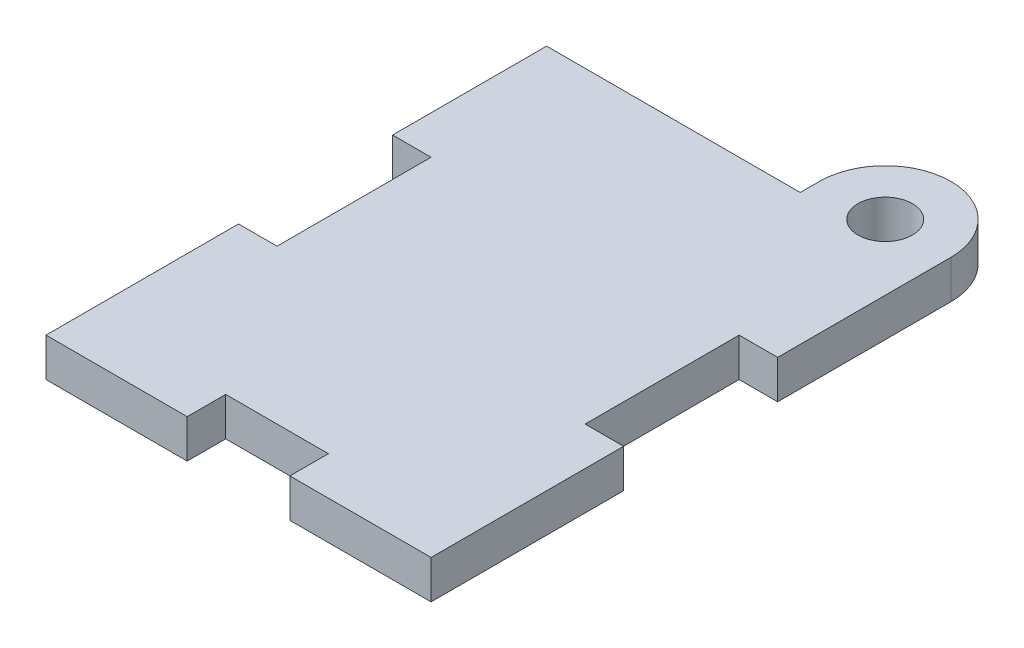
ISO-10303-21;
HEADER;
FILE_DESCRIPTION(('STEP AP214'),'2;1');
FILE_NAME('part.step','',(''),(''),'','','');
FILE_SCHEMA(('AUTOMOTIVE_DESIGN { 1 0 10303 214 1 1 1 1 }'));
ENDSEC;
DATA;
#1=APPLICATION_CONTEXT('core data for automotive mechanical design processes');
#2=APPLICATION_PROTOCOL_DEFINITION('international standard','automotive_design',2000,#1);
#3=PRODUCT_CONTEXT('',#1,'mechanical');
#4=PRODUCT('Part','Part','',(#3));
#5=PRODUCT_RELATED_PRODUCT_CATEGORY('part','',(#4));
#6=PRODUCT_DEFINITION_FORMATION('','',#4);
#7=PRODUCT_DEFINITION_CONTEXT('part definition',#1,'design');
#8=PRODUCT_DEFINITION('design','',#6,#7);
#9=PRODUCT_DEFINITION_SHAPE('','',#8);
#10=(LENGTH_UNIT() NAMED_UNIT(*) SI_UNIT(.MILLI.,.METRE.));
#11=(NAMED_UNIT(*) PLANE_ANGLE_UNIT() SI_UNIT($,.RADIAN.));
#12=(NAMED_UNIT(*) SI_UNIT($,.STERADIAN.) SOLID_ANGLE_UNIT());
#13=UNCERTAINTY_MEASURE_WITH_UNIT(LENGTH_MEASURE(1.E-05),#10,'distance_accuracy_value','');
#14=(GEOMETRIC_REPRESENTATION_CONTEXT(3) GLOBAL_UNCERTAINTY_ASSIGNED_CONTEXT((#13)) GLOBAL_UNIT_ASSIGNED_CONTEXT((#10,
#11,#12)) REPRESENTATION_CONTEXT('',''));
#15=CARTESIAN_POINT('',(0.,0.,0.));
#16=DIRECTION('',(0.,0.,1.));
#17=DIRECTION('',(1.,0.,0.));
#18=AXIS2_PLACEMENT_3D('',#15,#16,#17);
#19=CARTESIAN_POINT('',(10.4549359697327,3.175,-39.6875));
#20=DIRECTION('',(0.,-1.,0.));
#21=DIRECTION('',(0.,0.,-1.));
#22=AXIS2_PLACEMENT_3D('',#19,#20,#21);
#23=PLANE('',#22);
#24=DIRECTION('',(0.,0.,1.));
#25=VECTOR('',#24,1.);
#26=CARTESIAN_POINT('',(-15.875,3.175,-25.4));
#27=LINE('',#26,#25);
#28=CARTESIAN_POINT('',(-15.875,3.175,-38.1));
#29=VERTEX_POINT('',#28);
#30=CARTESIAN_POINT('',(-15.875,3.175,-25.4));
#31=VERTEX_POINT('',#30);
#32=EDGE_CURVE('E267',#29,#31,#27,.T.);
#33=ORIENTED_EDGE('',*,*,#32,.T.);
#34=DIRECTION('',(1.,0.,0.));
#35=VECTOR('',#34,1.);
#36=CARTESIAN_POINT('',(-12.7,3.175,-25.4));
#37=LINE('',#36,#35);
#38=CARTESIAN_POINT('',(-12.7,3.175,-25.4));
#39=VERTEX_POINT('',#38);
#40=EDGE_CURVE('E126',#31,#39,#37,.T.);
#41=ORIENTED_EDGE('',*,*,#40,.T.);
#42=DIRECTION('',(0.,0.,1.));
#43=VECTOR('',#42,1.);
#44=CARTESIAN_POINT('',(-12.7,3.175,-12.7));
#45=LINE('',#44,#43);
#46=CARTESIAN_POINT('',(-12.7,3.175,-12.7));
#47=VERTEX_POINT('',#46);
#48=EDGE_CURVE('E261',#39,#47,#45,.T.);
#49=ORIENTED_EDGE('',*,*,#48,.T.);
#50=DIRECTION('',(-1.,0.,0.));
#51=VECTOR('',#50,1.);
#52=CARTESIAN_POINT('',(-15.875,3.175,-12.7));
#53=LINE('',#52,#51);
#54=CARTESIAN_POINT('',(-15.875,3.175,-12.7));
#55=VERTEX_POINT('',#54);
#56=EDGE_CURVE('E253',#47,#55,#53,.T.);
#57=ORIENTED_EDGE('',*,*,#56,.T.);
#58=DIRECTION('',(0.,0.,1.));
#59=VECTOR('',#58,1.);
#60=CARTESIAN_POINT('',(-15.875,3.175,3.175));
#61=LINE('',#60,#59);
#62=CARTESIAN_POINT('',(-15.875,3.175,3.175));
#63=VERTEX_POINT('',#62);
#64=EDGE_CURVE('E249',#55,#63,#61,.T.);
#65=ORIENTED_EDGE('',*,*,#64,.T.);
#66=DIRECTION('',(1.,0.,0.));
#67=VECTOR('',#66,1.);
#68=CARTESIAN_POINT('',(-4.23333333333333,3.175,3.175));
#69=LINE('',#68,#67);
#70=CARTESIAN_POINT('',(-4.23333333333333,3.175,3.175));
#71=VERTEX_POINT('',#70);
#72=EDGE_CURVE('E245',#63,#71,#69,.T.);
#73=ORIENTED_EDGE('',*,*,#72,.T.);
#74=DIRECTION('',(0.,0.,-1.));
#75=VECTOR('',#74,1.);
#76=CARTESIAN_POINT('',(-4.23333333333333,3.175,0.));
#77=LINE('',#76,#75);
#78=CARTESIAN_POINT('',(-4.23333333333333,3.175,0.));
#79=VERTEX_POINT('',#78);
#80=EDGE_CURVE('E242',#71,#79,#77,.T.);
#81=ORIENTED_EDGE('',*,*,#80,.T.);
#82=DIRECTION('',(1.,0.,0.));
#83=VECTOR('',#82,1.);
#84=CARTESIAN_POINT('',(4.23333333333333,3.175,0.));
#85=LINE('',#84,#83);
#86=CARTESIAN_POINT('',(4.23333333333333,3.175,0.));
#87=VERTEX_POINT('',#86);
#88=EDGE_CURVE('E234',#79,#87,#85,.T.);
#89=ORIENTED_EDGE('',*,*,#88,.T.);
#90=DIRECTION('',(0.,0.,1.));
#91=VECTOR('',#90,1.);
#92=CARTESIAN_POINT('',(4.23333333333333,3.175,3.175));
#93=LINE('',#92,#91);
#94=CARTESIAN_POINT('',(4.23333333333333,3.175,3.175));
#95=VERTEX_POINT('',#94);
#96=EDGE_CURVE('E230',#87,#95,#93,.T.);
#97=ORIENTED_EDGE('',*,*,#96,.T.);
#98=DIRECTION('',(1.,0.,0.));
#99=VECTOR('',#98,1.);
#100=CARTESIAN_POINT('',(15.875,3.175,3.175));
#101=LINE('',#100,#99);
#102=CARTESIAN_POINT('',(15.875,3.175,3.175));
#103=VERTEX_POINT('',#102);
#104=EDGE_CURVE('E226',#95,#103,#101,.T.);
#105=ORIENTED_EDGE('',*,*,#104,.T.);
#106=DIRECTION('',(0.,0.,-1.));
#107=VECTOR('',#106,1.);
#108=CARTESIAN_POINT('',(15.875,3.175,-12.7));
#109=LINE('',#108,#107);
#110=CARTESIAN_POINT('',(15.875,3.175,-12.7));
#111=VERTEX_POINT('',#110);
#112=EDGE_CURVE('E223',#103,#111,#109,.T.);
#113=ORIENTED_EDGE('',*,*,#112,.T.);
#114=DIRECTION('',(-1.,0.,0.));
#115=VECTOR('',#114,1.);
#116=CARTESIAN_POINT('',(12.7,3.175,-12.7));
#117=LINE('',#116,#115);
#118=CARTESIAN_POINT('',(12.7,3.175,-12.7));
#119=VERTEX_POINT('',#118);
#120=EDGE_CURVE('E215',#111,#119,#117,.T.);
#121=ORIENTED_EDGE('',*,*,#120,.T.);
#122=DIRECTION('',(0.,0.,-1.));
#123=VECTOR('',#122,1.);
#124=CARTESIAN_POINT('',(12.7,3.175,-25.4));
#125=LINE('',#124,#123);
#126=CARTESIAN_POINT('',(12.7,3.175,-25.4));
#127=VERTEX_POINT('',#126);
#128=EDGE_CURVE('E211',#119,#127,#125,.T.);
#129=ORIENTED_EDGE('',*,*,#128,.T.);
#130=DIRECTION('',(1.,0.,0.));
#131=VECTOR('',#130,1.);
#132=CARTESIAN_POINT('',(15.875,3.175,-25.4));
#133=LINE('',#132,#131);
#134=CARTESIAN_POINT('',(15.875,3.175,-25.4));
#135=VERTEX_POINT('',#134);
#136=EDGE_CURVE('E207',#127,#135,#133,.T.);
#137=ORIENTED_EDGE('',*,*,#136,.T.);
#138=DIRECTION('',(0.,0.,-1.));
#139=VECTOR('',#138,1.);
#140=CARTESIAN_POINT('',(15.875,3.175,-39.6875));
#141=LINE('',#140,#139);
#142=CARTESIAN_POINT('',(15.875,3.175,-39.6875));
#143=VERTEX_POINT('',#142);
#144=EDGE_CURVE('E175',#135,#143,#141,.T.);
#145=ORIENTED_EDGE('',*,*,#144,.T.);
#146=CARTESIAN_POINT('',(10.4549359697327,3.175,-39.6875));
#147=DIRECTION('',(0.,1.,0.));
#148=DIRECTION('',(0.,0.,-1.));
#149=AXIS2_PLACEMENT_3D('',#146,#147,#148);
#150=CIRCLE('',#149,5.42006403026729);
#151=CARTESIAN_POINT('',(5.03487193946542,3.175,-39.6875));
#152=VERTEX_POINT('',#151);
#153=EDGE_CURVE('E169',#143,#152,#150,.T.);
#154=ORIENTED_EDGE('',*,*,#153,.T.);
#155=DIRECTION('',(0.,0.,1.));
#156=VECTOR('',#155,1.);
#157=CARTESIAN_POINT('',(5.03487193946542,3.175,-38.1));
#158=LINE('',#157,#156);
#159=CARTESIAN_POINT('',(5.03487193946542,3.175,-38.1));
#160=VERTEX_POINT('',#159);
#161=EDGE_CURVE('E173',#152,#160,#158,.T.);
#162=ORIENTED_EDGE('',*,*,#161,.T.);
#163=DIRECTION('',(-1.,0.,0.));
#164=VECTOR('',#163,1.);
#165=CARTESIAN_POINT('',(-15.875,3.175,-38.1));
#166=LINE('',#165,#164);
#167=EDGE_CURVE('E53',#160,#29,#166,.T.);
#168=ORIENTED_EDGE('',*,*,#167,.T.);
#169=EDGE_LOOP('',(#33,#41,#49,#57,#65,#73,#81,#89,#97,#105,#113,#121,#129,#137,#145,#154,#162,#168));
#170=FACE_BOUND('',#169,.T.);
#171=CARTESIAN_POINT('',(10.4549359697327,3.175,-39.6875));
#172=DIRECTION('',(0.,1.,0.));
#173=DIRECTION('',(0.,0.,1.));
#174=AXIS2_PLACEMENT_3D('',#171,#172,#173);
#175=CIRCLE('',#174,2.24506403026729);
#176=CARTESIAN_POINT('',(10.4549359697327,3.175,-37.4424359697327));
#177=VERTEX_POINT('',#176);
#178=EDGE_CURVE('E273',#177,#177,#175,.T.);
#179=ORIENTED_EDGE('',*,*,#178,.F.);
#180=EDGE_LOOP('',(#179));
#181=FACE_BOUND('',#180,.T.);
#182=ADVANCED_FACE('F36',(#170,#181),#23,.F.);
#183=CARTESIAN_POINT('',(10.4549359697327,0.,-39.6875));
#184=DIRECTION('',(0.,-1.,0.));
#185=DIRECTION('',(0.,0.,-1.));
#186=AXIS2_PLACEMENT_3D('',#183,#184,#185);
#187=PLANE('',#186);
#188=DIRECTION('',(0.,0.,1.));
#189=VECTOR('',#188,1.);
#190=CARTESIAN_POINT('',(-15.875,0.,-25.4));
#191=LINE('',#190,#189);
#192=CARTESIAN_POINT('',(-15.875,0.,-38.1));
#193=VERTEX_POINT('',#192);
#194=CARTESIAN_POINT('',(-15.875,0.,-25.4));
#195=VERTEX_POINT('',#194);
#196=EDGE_CURVE('E277',#193,#195,#191,.T.);
#197=ORIENTED_EDGE('',*,*,#196,.F.);
#198=DIRECTION('',(-1.,0.,0.));
#199=VECTOR('',#198,1.);
#200=CARTESIAN_POINT('',(-15.875,0.,-38.1));
#201=LINE('',#200,#199);
#202=CARTESIAN_POINT('',(5.03487193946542,0.,-38.1));
#203=VERTEX_POINT('',#202);
#204=EDGE_CURVE('E118',#203,#193,#201,.T.);
#205=ORIENTED_EDGE('',*,*,#204,.F.);
#206=DIRECTION('',(0.,0.,1.));
#207=VECTOR('',#206,1.);
#208=CARTESIAN_POINT('',(5.03487193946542,0.,-38.1));
#209=LINE('',#208,#207);
#210=CARTESIAN_POINT('',(5.03487193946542,0.,-39.6875));
#211=VERTEX_POINT('',#210);
#212=EDGE_CURVE('E112',#211,#203,#209,.T.);
#213=ORIENTED_EDGE('',*,*,#212,.F.);
#214=CARTESIAN_POINT('',(10.4549359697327,0.,-39.6875));
#215=DIRECTION('',(0.,1.,0.));
#216=DIRECTION('',(0.,0.,-1.));
#217=AXIS2_PLACEMENT_3D('',#214,#215,#216);
#218=CIRCLE('',#217,5.42006403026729);
#219=CARTESIAN_POINT('',(15.875,0.,-39.6875));
#220=VERTEX_POINT('',#219);
#221=EDGE_CURVE('E184',#220,#211,#218,.T.);
#222=ORIENTED_EDGE('',*,*,#221,.F.);
#223=DIRECTION('',(0.,0.,-1.));
#224=VECTOR('',#223,1.);
#225=CARTESIAN_POINT('',(15.875,0.,-39.6875));
#226=LINE('',#225,#224);
#227=CARTESIAN_POINT('',(15.875,0.,-25.4));
#228=VERTEX_POINT('',#227);
#229=EDGE_CURVE('E311',#228,#220,#226,.T.);
#230=ORIENTED_EDGE('',*,*,#229,.F.);
#231=DIRECTION('',(1.,0.,0.));
#232=VECTOR('',#231,1.);
#233=CARTESIAN_POINT('',(15.875,0.,-25.4));
#234=LINE('',#233,#232);
#235=CARTESIAN_POINT('',(12.7,0.,-25.4));
#236=VERTEX_POINT('',#235);
#237=EDGE_CURVE('E309',#236,#228,#234,.T.);
#238=ORIENTED_EDGE('',*,*,#237,.F.);
#239=DIRECTION('',(0.,0.,-1.));
#240=VECTOR('',#239,1.);
#241=CARTESIAN_POINT('',(12.7,0.,-25.4));
#242=LINE('',#241,#240);
#243=CARTESIAN_POINT('',(12.7,0.,-12.7));
#244=VERTEX_POINT('',#243);
#245=EDGE_CURVE('E307',#244,#236,#242,.T.);
#246=ORIENTED_EDGE('',*,*,#245,.F.);
#247=DIRECTION('',(-1.,0.,0.));
#248=VECTOR('',#247,1.);
#249=CARTESIAN_POINT('',(12.7,0.,-12.7));
#250=LINE('',#249,#248);
#251=CARTESIAN_POINT('',(15.875,0.,-12.7));
#252=VERTEX_POINT('',#251);
#253=EDGE_CURVE('E305',#252,#244,#250,.T.);
#254=ORIENTED_EDGE('',*,*,#253,.F.);
#255=DIRECTION('',(0.,0.,-1.));
#256=VECTOR('',#255,1.);
#257=CARTESIAN_POINT('',(15.875,0.,-12.7));
#258=LINE('',#257,#256);
#259=CARTESIAN_POINT('',(15.875,0.,3.175));
#260=VERTEX_POINT('',#259);
#261=EDGE_CURVE('E303',#260,#252,#258,.T.);
#262=ORIENTED_EDGE('',*,*,#261,.F.);
#263=DIRECTION('',(1.,0.,0.));
#264=VECTOR('',#263,1.);
#265=CARTESIAN_POINT('',(15.875,0.,3.175));
#266=LINE('',#265,#264);
#267=CARTESIAN_POINT('',(4.23333333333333,0.,3.175));
#268=VERTEX_POINT('',#267);
#269=EDGE_CURVE('E301',#268,#260,#266,.T.);
#270=ORIENTED_EDGE('',*,*,#269,.F.);
#271=DIRECTION('',(0.,0.,1.));
#272=VECTOR('',#271,1.);
#273=CARTESIAN_POINT('',(4.23333333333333,0.,3.175));
#274=LINE('',#273,#272);
#275=CARTESIAN_POINT('',(4.23333333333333,0.,0.));
#276=VERTEX_POINT('',#275);
#277=EDGE_CURVE('E299',#276,#268,#274,.T.);
#278=ORIENTED_EDGE('',*,*,#277,.F.);
#279=DIRECTION('',(1.,0.,0.));
#280=VECTOR('',#279,1.);
#281=CARTESIAN_POINT('',(4.23333333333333,0.,0.));
#282=LINE('',#281,#280);
#283=CARTESIAN_POINT('',(-4.23333333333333,0.,0.));
#284=VERTEX_POINT('',#283);
#285=EDGE_CURVE('E297',#284,#276,#282,.T.);
#286=ORIENTED_EDGE('',*,*,#285,.F.);
#287=DIRECTION('',(0.,0.,-1.));
#288=VECTOR('',#287,1.);
#289=CARTESIAN_POINT('',(-4.23333333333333,0.,0.));
#290=LINE('',#289,#288);
#291=CARTESIAN_POINT('',(-4.23333333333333,0.,3.175));
#292=VERTEX_POINT('',#291);
#293=EDGE_CURVE('E295',#292,#284,#290,.T.);
#294=ORIENTED_EDGE('',*,*,#293,.F.);
#295=DIRECTION('',(1.,0.,0.));
#296=VECTOR('',#295,1.);
#297=CARTESIAN_POINT('',(-4.23333333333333,0.,3.175));
#298=LINE('',#297,#296);
#299=CARTESIAN_POINT('',(-15.875,0.,3.175));
#300=VERTEX_POINT('',#299);
#301=EDGE_CURVE('E293',#300,#292,#298,.T.);
#302=ORIENTED_EDGE('',*,*,#301,.F.);
#303=DIRECTION('',(0.,0.,1.));
#304=VECTOR('',#303,1.);
#305=CARTESIAN_POINT('',(-15.875,0.,3.175));
#306=LINE('',#305,#304);
#307=CARTESIAN_POINT('',(-15.875,0.,-12.7));
#308=VERTEX_POINT('',#307);
#309=EDGE_CURVE('E291',#308,#300,#306,.T.);
#310=ORIENTED_EDGE('',*,*,#309,.F.);
#311=DIRECTION('',(-1.,0.,0.));
#312=VECTOR('',#311,1.);
#313=CARTESIAN_POINT('',(-15.875,0.,-12.7));
#314=LINE('',#313,#312);
#315=CARTESIAN_POINT('',(-12.7,0.,-12.7));
#316=VERTEX_POINT('',#315);
#317=EDGE_CURVE('E289',#316,#308,#314,.T.);
#318=ORIENTED_EDGE('',*,*,#317,.F.);
#319=DIRECTION('',(0.,0.,1.));
#320=VECTOR('',#319,1.);
#321=CARTESIAN_POINT('',(-12.7,0.,-12.7));
#322=LINE('',#321,#320);
#323=CARTESIAN_POINT('',(-12.7,0.,-25.4));
#324=VERTEX_POINT('',#323);
#325=EDGE_CURVE('E285',#324,#316,#322,.T.);
#326=ORIENTED_EDGE('',*,*,#325,.F.);
#327=DIRECTION('',(1.,0.,0.));
#328=VECTOR('',#327,1.);
#329=CARTESIAN_POINT('',(-12.7,0.,-25.4));
#330=LINE('',#329,#328);
#331=EDGE_CURVE('E281',#195,#324,#330,.T.);
#332=ORIENTED_EDGE('',*,*,#331,.F.);
#333=EDGE_LOOP('',(#197,#205,#213,#222,#230,#238,#246,#254,#262,#270,#278,#286,#294,#302,#310,
#318,#326,#332));
#334=FACE_BOUND('',#333,.T.);
#335=CARTESIAN_POINT('',(10.4549359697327,0.,-39.6875));
#336=DIRECTION('',(0.,1.,0.));
#337=DIRECTION('',(0.,0.,1.));
#338=AXIS2_PLACEMENT_3D('',#335,#336,#337);
#339=CIRCLE('',#338,2.24506403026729);
#340=CARTESIAN_POINT('',(10.4549359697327,0.,-37.4424359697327));
#341=VERTEX_POINT('',#340);
#342=EDGE_CURVE('E271',#341,#341,#339,.T.);
#343=ORIENTED_EDGE('',*,*,#342,.T.);
#344=EDGE_LOOP('',(#343));
#345=FACE_BOUND('',#344,.T.);
#346=ADVANCED_FACE('F362',(#334,#345),#187,.T.);
#347=CARTESIAN_POINT('',(-15.875,3.175,-25.4));
#348=DIRECTION('',(1.,0.,0.));
#349=DIRECTION('',(0.,0.,-1.));
#350=AXIS2_PLACEMENT_3D('',#347,#348,#349);
#351=PLANE('',#350);
#352=ORIENTED_EDGE('',*,*,#196,.T.);
#353=DIRECTION('',(0.,-1.,0.));
#354=VECTOR('',#353,1.);
#355=CARTESIAN_POINT('',(-15.875,3.175,-25.4));
#356=LINE('',#355,#354);
#357=EDGE_CURVE('E12',#31,#195,#356,.T.);
#358=ORIENTED_EDGE('',*,*,#357,.F.);
#359=ORIENTED_EDGE('',*,*,#32,.F.);
#360=DIRECTION('',(0.,-1.,0.));
#361=VECTOR('',#360,1.);
#362=CARTESIAN_POINT('',(-15.875,3.175,-38.1));
#363=LINE('',#362,#361);
#364=EDGE_CURVE('E192',#29,#193,#363,.T.);
#365=ORIENTED_EDGE('',*,*,#364,.T.);
#366=EDGE_LOOP('',(#352,#358,#359,#365));
#367=FACE_BOUND('',#366,.T.);
#368=ADVANCED_FACE('F38',(#367),#351,.F.);
#369=CARTESIAN_POINT('',(-12.7,3.175,-25.4));
#370=DIRECTION('',(0.,0.,-1.));
#371=DIRECTION('',(-1.,0.,0.));
#372=AXIS2_PLACEMENT_3D('',#369,#370,#371);
#373=PLANE('',#372);
#374=ORIENTED_EDGE('',*,*,#331,.T.);
#375=DIRECTION('',(0.,-1.,0.));
#376=VECTOR('',#375,1.);
#377=CARTESIAN_POINT('',(-12.7,3.175,-25.4));
#378=LINE('',#377,#376);
#379=EDGE_CURVE('E45',#39,#324,#378,.T.);
#380=ORIENTED_EDGE('',*,*,#379,.F.);
#381=ORIENTED_EDGE('',*,*,#40,.F.);
#382=ORIENTED_EDGE('',*,*,#357,.T.);
#383=EDGE_LOOP('',(#374,#380,#381,#382));
#384=FACE_BOUND('',#383,.T.);
#385=ADVANCED_FACE('F564',(#384),#373,.F.);
#386=CARTESIAN_POINT('',(-12.7,3.175,-12.7));
#387=DIRECTION('',(1.,0.,0.));
#388=DIRECTION('',(0.,0.,-1.));
#389=AXIS2_PLACEMENT_3D('',#386,#387,#388);
#390=PLANE('',#389);
#391=ORIENTED_EDGE('',*,*,#325,.T.);
#392=DIRECTION('',(0.,-1.,0.));
#393=VECTOR('',#392,1.);
#394=CARTESIAN_POINT('',(-12.7,3.175,-12.7));
#395=LINE('',#394,#393);
#396=EDGE_CURVE('E352',#47,#316,#395,.T.);
#397=ORIENTED_EDGE('',*,*,#396,.F.);
#398=ORIENTED_EDGE('',*,*,#48,.F.);
#399=ORIENTED_EDGE('',*,*,#379,.T.);
#400=EDGE_LOOP('',(#391,#397,#398,#399));
#401=FACE_BOUND('',#400,.T.);
#402=ADVANCED_FACE('F358',(#401),#390,.F.);
#403=CARTESIAN_POINT('',(-15.875,3.175,-12.7));
#404=DIRECTION('',(0.,0.,1.));
#405=DIRECTION('',(1.,0.,0.));
#406=AXIS2_PLACEMENT_3D('',#403,#404,#405);
#407=PLANE('',#406);
#408=ORIENTED_EDGE('',*,*,#317,.T.);
#409=DIRECTION('',(0.,-1.,0.));
#410=VECTOR('',#409,1.);
#411=CARTESIAN_POINT('',(-15.875,3.175,-12.7));
#412=LINE('',#411,#410);
#413=EDGE_CURVE('E349',#55,#308,#412,.T.);
#414=ORIENTED_EDGE('',*,*,#413,.F.);
#415=ORIENTED_EDGE('',*,*,#56,.F.);
#416=ORIENTED_EDGE('',*,*,#396,.T.);
#417=EDGE_LOOP('',(#408,#414,#415,#416));
#418=FACE_BOUND('',#417,.T.);
#419=ADVANCED_FACE('F368',(#418),#407,.F.);
#420=CARTESIAN_POINT('',(-15.875,3.175,3.175));
#421=DIRECTION('',(1.,0.,0.));
#422=DIRECTION('',(0.,0.,-1.));
#423=AXIS2_PLACEMENT_3D('',#420,#421,#422);
#424=PLANE('',#423);
#425=ORIENTED_EDGE('',*,*,#309,.T.);
#426=DIRECTION('',(0.,-1.,0.));
#427=VECTOR('',#426,1.);
#428=CARTESIAN_POINT('',(-15.875,3.175,3.175));
#429=LINE('',#428,#427);
#430=EDGE_CURVE('E346',#63,#300,#429,.T.);
#431=ORIENTED_EDGE('',*,*,#430,.F.);
#432=ORIENTED_EDGE('',*,*,#64,.F.);
#433=ORIENTED_EDGE('',*,*,#413,.T.);
#434=EDGE_LOOP('',(#425,#431,#432,#433));
#435=FACE_BOUND('',#434,.T.);
#436=ADVANCED_FACE('F372',(#435),#424,.F.);
#437=CARTESIAN_POINT('',(-4.23333333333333,3.175,3.175));
#438=DIRECTION('',(0.,0.,-1.));
#439=DIRECTION('',(-1.,0.,0.));
#440=AXIS2_PLACEMENT_3D('',#437,#438,#439);
#441=PLANE('',#440);
#442=ORIENTED_EDGE('',*,*,#301,.T.);
#443=DIRECTION('',(0.,-1.,0.));
#444=VECTOR('',#443,1.);
#445=CARTESIAN_POINT('',(-4.23333333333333,3.175,3.175));
#446=LINE('',#445,#444);
#447=EDGE_CURVE('E343',#71,#292,#446,.T.);
#448=ORIENTED_EDGE('',*,*,#447,.F.);
#449=ORIENTED_EDGE('',*,*,#72,.F.);
#450=ORIENTED_EDGE('',*,*,#430,.T.);
#451=EDGE_LOOP('',(#442,#448,#449,#450));
#452=FACE_BOUND('',#451,.T.);
#453=ADVANCED_FACE('F423',(#452),#441,.F.);
#454=CARTESIAN_POINT('',(-4.23333333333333,3.175,0.));
#455=DIRECTION('',(-1.,0.,0.));
#456=DIRECTION('',(0.,0.,1.));
#457=AXIS2_PLACEMENT_3D('',#454,#455,#456);
#458=PLANE('',#457);
#459=ORIENTED_EDGE('',*,*,#293,.T.);
#460=DIRECTION('',(0.,-1.,0.));
#461=VECTOR('',#460,1.);
#462=CARTESIAN_POINT('',(-4.23333333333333,3.175,0.));
#463=LINE('',#462,#461);
#464=EDGE_CURVE('E340',#79,#284,#463,.T.);
#465=ORIENTED_EDGE('',*,*,#464,.F.);
#466=ORIENTED_EDGE('',*,*,#80,.F.);
#467=ORIENTED_EDGE('',*,*,#447,.T.);
#468=EDGE_LOOP('',(#459,#465,#466,#467));
#469=FACE_BOUND('',#468,.T.);
#470=ADVANCED_FACE('F421',(#469),#458,.F.);
#471=CARTESIAN_POINT('',(4.23333333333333,3.175,0.));
#472=DIRECTION('',(0.,0.,-1.));
#473=DIRECTION('',(-1.,0.,0.));
#474=AXIS2_PLACEMENT_3D('',#471,#472,#473);
#475=PLANE('',#474);
#476=ORIENTED_EDGE('',*,*,#285,.T.);
#477=DIRECTION('',(0.,-1.,0.));
#478=VECTOR('',#477,1.);
#479=CARTESIAN_POINT('',(4.23333333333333,3.175,0.));
#480=LINE('',#479,#478);
#481=EDGE_CURVE('E337',#87,#276,#480,.T.);
#482=ORIENTED_EDGE('',*,*,#481,.F.);
#483=ORIENTED_EDGE('',*,*,#88,.F.);
#484=ORIENTED_EDGE('',*,*,#464,.T.);
#485=EDGE_LOOP('',(#476,#482,#483,#484));
#486=FACE_BOUND('',#485,.T.);
#487=ADVANCED_FACE('F416',(#486),#475,.F.);
#488=CARTESIAN_POINT('',(4.23333333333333,3.175,3.175));
#489=DIRECTION('',(1.,0.,0.));
#490=DIRECTION('',(0.,0.,-1.));
#491=AXIS2_PLACEMENT_3D('',#488,#489,#490);
#492=PLANE('',#491);
#493=ORIENTED_EDGE('',*,*,#277,.T.);
#494=DIRECTION('',(0.,-1.,0.));
#495=VECTOR('',#494,1.);
#496=CARTESIAN_POINT('',(4.23333333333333,3.175,3.175));
#497=LINE('',#496,#495);
#498=EDGE_CURVE('E334',#95,#268,#497,.T.);
#499=ORIENTED_EDGE('',*,*,#498,.F.);
#500=ORIENTED_EDGE('',*,*,#96,.F.);
#501=ORIENTED_EDGE('',*,*,#481,.T.);
#502=EDGE_LOOP('',(#493,#499,#500,#501));
#503=FACE_BOUND('',#502,.T.);
#504=ADVANCED_FACE('F411',(#503),#492,.F.);
#505=CARTESIAN_POINT('',(15.875,3.175,3.175));
#506=DIRECTION('',(0.,0.,-1.));
#507=DIRECTION('',(-1.,0.,0.));
#508=AXIS2_PLACEMENT_3D('',#505,#506,#507);
#509=PLANE('',#508);
#510=ORIENTED_EDGE('',*,*,#269,.T.);
#511=DIRECTION('',(0.,-1.,0.));
#512=VECTOR('',#511,1.);
#513=CARTESIAN_POINT('',(15.875,3.175,3.175));
#514=LINE('',#513,#512);
#515=EDGE_CURVE('E331',#103,#260,#514,.T.);
#516=ORIENTED_EDGE('',*,*,#515,.F.);
#517=ORIENTED_EDGE('',*,*,#104,.F.);
#518=ORIENTED_EDGE('',*,*,#498,.T.);
#519=EDGE_LOOP('',(#510,#516,#517,#518));
#520=FACE_BOUND('',#519,.T.);
#521=ADVANCED_FACE('F407',(#520),#509,.F.);
#522=CARTESIAN_POINT('',(15.875,3.175,-12.7));
#523=DIRECTION('',(-1.,0.,0.));
#524=DIRECTION('',(0.,0.,1.));
#525=AXIS2_PLACEMENT_3D('',#522,#523,#524);
#526=PLANE('',#525);
#527=ORIENTED_EDGE('',*,*,#261,.T.);
#528=DIRECTION('',(0.,-1.,0.));
#529=VECTOR('',#528,1.);
#530=CARTESIAN_POINT('',(15.875,3.175,-12.7));
#531=LINE('',#530,#529);
#532=EDGE_CURVE('E328',#111,#252,#531,.T.);
#533=ORIENTED_EDGE('',*,*,#532,.F.);
#534=ORIENTED_EDGE('',*,*,#112,.F.);
#535=ORIENTED_EDGE('',*,*,#515,.T.);
#536=EDGE_LOOP('',(#527,#533,#534,#535));
#537=FACE_BOUND('',#536,.T.);
#538=ADVANCED_FACE('F403',(#537),#526,.F.);
#539=CARTESIAN_POINT('',(12.7,3.175,-12.7));
#540=DIRECTION('',(0.,0.,1.));
#541=DIRECTION('',(1.,0.,0.));
#542=AXIS2_PLACEMENT_3D('',#539,#540,#541);
#543=PLANE('',#542);
#544=ORIENTED_EDGE('',*,*,#253,.T.);
#545=DIRECTION('',(0.,-1.,0.));
#546=VECTOR('',#545,1.);
#547=CARTESIAN_POINT('',(12.7,3.175,-12.7));
#548=LINE('',#547,#546);
#549=EDGE_CURVE('E325',#119,#244,#548,.T.);
#550=ORIENTED_EDGE('',*,*,#549,.F.);
#551=ORIENTED_EDGE('',*,*,#120,.F.);
#552=ORIENTED_EDGE('',*,*,#532,.T.);
#553=EDGE_LOOP('',(#544,#550,#551,#552));
#554=FACE_BOUND('',#553,.T.);
#555=ADVANCED_FACE('F386',(#554),#543,.F.);
#556=CARTESIAN_POINT('',(12.7,3.175,-25.4));
#557=DIRECTION('',(-1.,0.,0.));
#558=DIRECTION('',(0.,0.,1.));
#559=AXIS2_PLACEMENT_3D('',#556,#557,#558);
#560=PLANE('',#559);
#561=ORIENTED_EDGE('',*,*,#245,.T.);
#562=DIRECTION('',(0.,-1.,0.));
#563=VECTOR('',#562,1.);
#564=CARTESIAN_POINT('',(12.7,3.175,-25.4));
#565=LINE('',#564,#563);
#566=EDGE_CURVE('E322',#127,#236,#565,.T.);
#567=ORIENTED_EDGE('',*,*,#566,.F.);
#568=ORIENTED_EDGE('',*,*,#128,.F.);
#569=ORIENTED_EDGE('',*,*,#549,.T.);
#570=EDGE_LOOP('',(#561,#567,#568,#569));
#571=FACE_BOUND('',#570,.T.);
#572=ADVANCED_FACE('F390',(#571),#560,.F.);
#573=CARTESIAN_POINT('',(15.875,3.175,-25.4));
#574=DIRECTION('',(0.,0.,-1.));
#575=DIRECTION('',(-1.,0.,0.));
#576=AXIS2_PLACEMENT_3D('',#573,#574,#575);
#577=PLANE('',#576);
#578=ORIENTED_EDGE('',*,*,#237,.T.);
#579=DIRECTION('',(0.,-1.,0.));
#580=VECTOR('',#579,1.);
#581=CARTESIAN_POINT('',(15.875,3.175,-25.4));
#582=LINE('',#581,#580);
#583=EDGE_CURVE('E319',#135,#228,#582,.T.);
#584=ORIENTED_EDGE('',*,*,#583,.F.);
#585=ORIENTED_EDGE('',*,*,#136,.F.);
#586=ORIENTED_EDGE('',*,*,#566,.T.);
#587=EDGE_LOOP('',(#578,#584,#585,#586));
#588=FACE_BOUND('',#587,.T.);
#589=ADVANCED_FACE('F395',(#588),#577,.F.);
#590=CARTESIAN_POINT('',(15.875,3.175,-39.6875));
#591=DIRECTION('',(-1.,0.,0.));
#592=DIRECTION('',(0.,0.,1.));
#593=AXIS2_PLACEMENT_3D('',#590,#591,#592);
#594=PLANE('',#593);
#595=ORIENTED_EDGE('',*,*,#229,.T.);
#596=DIRECTION('',(0.,-1.,0.));
#597=VECTOR('',#596,1.);
#598=CARTESIAN_POINT('',(15.875,3.175,-39.6875));
#599=LINE('',#598,#597);
#600=EDGE_CURVE('E185',#143,#220,#599,.T.);
#601=ORIENTED_EDGE('',*,*,#600,.F.);
#602=ORIENTED_EDGE('',*,*,#144,.F.);
#603=ORIENTED_EDGE('',*,*,#583,.T.);
#604=EDGE_LOOP('',(#595,#601,#602,#603));
#605=FACE_BOUND('',#604,.T.);
#606=ADVANCED_FACE('F398',(#605),#594,.F.);
#607=CARTESIAN_POINT('',(10.4549359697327,3.175,-39.6875));
#608=DIRECTION('',(0.,-1.,0.));
#609=DIRECTION('',(0.,0.,-1.));
#610=AXIS2_PLACEMENT_3D('',#607,#608,#609);
#611=CYLINDRICAL_SURFACE('',#610,5.42006403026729);
#612=ORIENTED_EDGE('',*,*,#221,.T.);
#613=DIRECTION('',(0.,-1.,0.));
#614=VECTOR('',#613,1.);
#615=CARTESIAN_POINT('',(5.03487193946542,3.175,-39.6875));
#616=LINE('',#615,#614);
#617=EDGE_CURVE('E181',#152,#211,#616,.T.);
#618=ORIENTED_EDGE('',*,*,#617,.F.);
#619=ORIENTED_EDGE('',*,*,#153,.F.);
#620=ORIENTED_EDGE('',*,*,#600,.T.);
#621=EDGE_LOOP('',(#612,#618,#619,#620));
#622=FACE_BOUND('',#621,.T.);
#623=ADVANCED_FACE('F182',(#622),#611,.T.);
#624=CARTESIAN_POINT('',(5.03487193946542,3.175,-38.1));
#625=DIRECTION('',(1.,0.,0.));
#626=DIRECTION('',(0.,0.,-1.));
#627=AXIS2_PLACEMENT_3D('',#624,#625,#626);
#628=PLANE('',#627);
#629=ORIENTED_EDGE('',*,*,#212,.T.);
#630=DIRECTION('',(0.,-1.,0.));
#631=VECTOR('',#630,1.);
#632=CARTESIAN_POINT('',(5.03487193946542,3.175,-38.1));
#633=LINE('',#632,#631);
#634=EDGE_CURVE('E186',#160,#203,#633,.T.);
#635=ORIENTED_EDGE('',*,*,#634,.F.);
#636=ORIENTED_EDGE('',*,*,#161,.F.);
#637=ORIENTED_EDGE('',*,*,#617,.T.);
#638=EDGE_LOOP('',(#629,#635,#636,#637));
#639=FACE_BOUND('',#638,.T.);
#640=ADVANCED_FACE('F188',(#639),#628,.F.);
#641=CARTESIAN_POINT('',(-15.875,3.175,-38.1));
#642=DIRECTION('',(0.,0.,1.));
#643=DIRECTION('',(1.,0.,0.));
#644=AXIS2_PLACEMENT_3D('',#641,#642,#643);
#645=PLANE('',#644);
#646=ORIENTED_EDGE('',*,*,#204,.T.);
#647=ORIENTED_EDGE('',*,*,#364,.F.);
#648=ORIENTED_EDGE('',*,*,#167,.F.);
#649=ORIENTED_EDGE('',*,*,#634,.T.);
#650=EDGE_LOOP('',(#646,#647,#648,#649));
#651=FACE_BOUND('',#650,.T.);
#652=ADVANCED_FACE('F441',(#651),#645,.F.);
#653=CARTESIAN_POINT('',(10.4549359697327,3.175,-39.6875));
#654=DIRECTION('',(0.,-1.,0.));
#655=DIRECTION('',(0.,0.,-1.));
#656=AXIS2_PLACEMENT_3D('',#653,#654,#655);
#657=CYLINDRICAL_SURFACE('',#656,2.24506403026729);
#658=ORIENTED_EDGE('',*,*,#178,.T.);
#659=EDGE_LOOP('',(#658));
#660=FACE_BOUND('',#659,.T.);
#661=ORIENTED_EDGE('',*,*,#342,.F.);
#662=EDGE_LOOP('',(#661));
#663=FACE_BOUND('',#662,.T.);
#664=ADVANCED_FACE('F439',(#660,#663),#657,.F.);
#665=CLOSED_SHELL('',(#182,#346,#368,#385,#402,#419,#436,#453,#470,#487,#504,#521,#538,#555,
#572,#589,#606,#623,#640,#652,#664));
#666=MANIFOLD_SOLID_BREP('B2',#665);
#667=ADVANCED_BREP_SHAPE_REPRESENTATION('',(#18,#666),#14);
#668=SHAPE_DEFINITION_REPRESENTATION(#9,#667);
ENDSEC;
END-ISO-10303-21;
